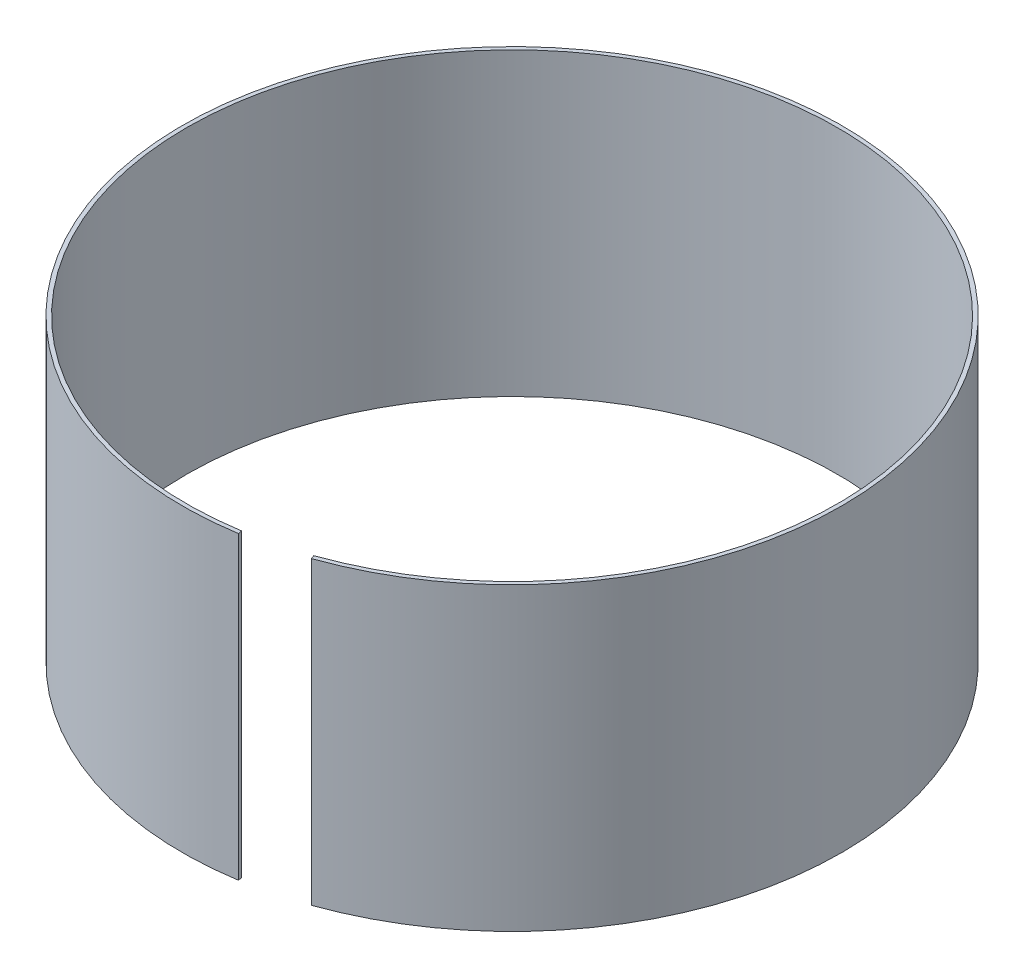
ISO-10303-21;
HEADER;
FILE_DESCRIPTION(('STEP AP214'),'2;1');
FILE_NAME('part.step','',(''),(''),'','','');
FILE_SCHEMA(('AUTOMOTIVE_DESIGN { 1 0 10303 214 1 1 1 1 }'));
ENDSEC;
DATA;
#1=APPLICATION_CONTEXT('core data for automotive mechanical design processes');
#2=APPLICATION_PROTOCOL_DEFINITION('international standard','automotive_design',2000,#1);
#3=PRODUCT_CONTEXT('',#1,'mechanical');
#4=PRODUCT('Part','Part','',(#3));
#5=PRODUCT_RELATED_PRODUCT_CATEGORY('part','',(#4));
#6=PRODUCT_DEFINITION_FORMATION('','',#4);
#7=PRODUCT_DEFINITION_CONTEXT('part definition',#1,'design');
#8=PRODUCT_DEFINITION('design','',#6,#7);
#9=PRODUCT_DEFINITION_SHAPE('','',#8);
#10=(LENGTH_UNIT() NAMED_UNIT(*) SI_UNIT(.MILLI.,.METRE.));
#11=(NAMED_UNIT(*) PLANE_ANGLE_UNIT() SI_UNIT($,.RADIAN.));
#12=(NAMED_UNIT(*) SI_UNIT($,.STERADIAN.) SOLID_ANGLE_UNIT());
#13=UNCERTAINTY_MEASURE_WITH_UNIT(LENGTH_MEASURE(1.E-05),#10,'distance_accuracy_value','');
#14=(GEOMETRIC_REPRESENTATION_CONTEXT(3) GLOBAL_UNCERTAINTY_ASSIGNED_CONTEXT((#13)) GLOBAL_UNIT_ASSIGNED_CONTEXT((#10,
#11,#12)) REPRESENTATION_CONTEXT('',''));
#15=CARTESIAN_POINT('',(0.,0.,0.));
#16=DIRECTION('',(0.,0.,1.));
#17=DIRECTION('',(1.,0.,0.));
#18=AXIS2_PLACEMENT_3D('',#15,#16,#17);
#19=CARTESIAN_POINT('',(0.,96.52,0.));
#20=DIRECTION('',(0.,-1.,0.));
#21=DIRECTION('',(0.,0.,-1.));
#22=AXIS2_PLACEMENT_3D('',#19,#20,#21);
#23=CYLINDRICAL_SURFACE('',#22,104.67922484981);
#24=CARTESIAN_POINT('',(0.,0.,0.));
#25=DIRECTION('',(0.,1.,0.));
#26=DIRECTION('',(1.,0.,0.));
#27=AXIS2_PLACEMENT_3D('',#24,#25,#26);
#28=CIRCLE('',#27,104.67922484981);
#29=CARTESIAN_POINT('',(16.4725699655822,0.,103.375019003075));
#30=VERTEX_POINT('',#29);
#31=CARTESIAN_POINT('',(34.9306081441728,0.,98.6792416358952));
#32=VERTEX_POINT('',#31);
#33=EDGE_CURVE('E79',#30,#32,#28,.F.);
#34=ORIENTED_EDGE('',*,*,#33,.T.);
#35=DIRECTION('',(0.,-1.,0.));
#36=VECTOR('',#35,1.);
#37=CARTESIAN_POINT('',(34.9306081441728,96.52,98.6792416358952));
#38=LINE('',#37,#36);
#39=CARTESIAN_POINT('',(34.9306081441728,96.52,98.6792416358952));
#40=VERTEX_POINT('',#39);
#41=EDGE_CURVE('E11',#40,#32,#38,.T.);
#42=ORIENTED_EDGE('',*,*,#41,.F.);
#43=CARTESIAN_POINT('',(0.,96.52,0.));
#44=DIRECTION('',(0.,1.,0.));
#45=DIRECTION('',(1.,0.,0.));
#46=AXIS2_PLACEMENT_3D('',#43,#44,#45);
#47=CIRCLE('',#46,104.67922484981);
#48=CARTESIAN_POINT('',(16.4725699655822,96.52,103.375019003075));
#49=VERTEX_POINT('',#48);
#50=EDGE_CURVE('E90',#49,#40,#47,.F.);
#51=ORIENTED_EDGE('',*,*,#50,.F.);
#52=DIRECTION('',(0.,-1.,0.));
#53=VECTOR('',#52,1.);
#54=CARTESIAN_POINT('',(16.4725699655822,96.52,103.375019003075));
#55=LINE('',#54,#53);
#56=EDGE_CURVE('E42',#49,#30,#55,.T.);
#57=ORIENTED_EDGE('',*,*,#56,.T.);
#58=EDGE_LOOP('',(#34,#42,#51,#57));
#59=FACE_BOUND('',#58,.T.);
#60=ADVANCED_FACE('F28',(#59),#23,.F.);
#61=CARTESIAN_POINT('',(35.3543968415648,96.52,99.8764480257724));
#62=DIRECTION('',(-0.942682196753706,0.,0.333691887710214));
#63=DIRECTION('',(0.333691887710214,0.,0.942682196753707));
#64=AXIS2_PLACEMENT_3D('',#61,#62,#63);
#65=PLANE('',#64);
#66=DIRECTION('',(-0.333691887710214,0.,-0.942682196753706));
#67=VECTOR('',#66,1.);
#68=CARTESIAN_POINT('',(35.3543968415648,0.,99.8764480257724));
#69=LINE('',#68,#67);
#70=CARTESIAN_POINT('',(35.3543968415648,0.,99.8764480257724));
#71=VERTEX_POINT('',#70);
#72=EDGE_CURVE('E73',#71,#32,#69,.T.);
#73=ORIENTED_EDGE('',*,*,#72,.F.);
#74=DIRECTION('',(0.,-1.,0.));
#75=VECTOR('',#74,1.);
#76=CARTESIAN_POINT('',(35.3543968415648,96.52,99.8764480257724));
#77=LINE('',#76,#75);
#78=CARTESIAN_POINT('',(35.3543968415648,96.52,99.8764480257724));
#79=VERTEX_POINT('',#78);
#80=EDGE_CURVE('E35',#79,#71,#77,.T.);
#81=ORIENTED_EDGE('',*,*,#80,.F.);
#82=DIRECTION('',(-0.333691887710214,0.,-0.942682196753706));
#83=VECTOR('',#82,1.);
#84=CARTESIAN_POINT('',(35.3543968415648,96.52,99.8764480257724));
#85=LINE('',#84,#83);
#86=EDGE_CURVE('E76',#79,#40,#85,.T.);
#87=ORIENTED_EDGE('',*,*,#86,.T.);
#88=ORIENTED_EDGE('',*,*,#41,.T.);
#89=EDGE_LOOP('',(#73,#81,#87,#88));
#90=FACE_BOUND('',#89,.T.);
#91=ADVANCED_FACE('F71',(#90),#65,.T.);
#92=CARTESIAN_POINT('',(0.,96.52,0.));
#93=DIRECTION('',(0.,-1.,0.));
#94=DIRECTION('',(0.,0.,-1.));
#95=AXIS2_PLACEMENT_3D('',#92,#93,#94);
#96=CYLINDRICAL_SURFACE('',#95,105.94922484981);
#97=CARTESIAN_POINT('',(0.,0.,0.));
#98=DIRECTION('',(0.,-1.,0.));
#99=DIRECTION('',(0.,0.,-1.));
#100=AXIS2_PLACEMENT_3D('',#97,#98,#99);
#101=CIRCLE('',#100,105.94922484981);
#102=CARTESIAN_POINT('',(16.6724201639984,0.,104.629195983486));
#103=VERTEX_POINT('',#102);
#104=EDGE_CURVE('E84',#103,#71,#101,.T.);
#105=ORIENTED_EDGE('',*,*,#104,.F.);
#106=DIRECTION('',(0.,-1.,0.));
#107=VECTOR('',#106,1.);
#108=CARTESIAN_POINT('',(16.6724201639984,96.52,104.629195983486));
#109=LINE('',#108,#107);
#110=CARTESIAN_POINT('',(16.6724201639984,96.52,104.629195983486));
#111=VERTEX_POINT('',#110);
#112=EDGE_CURVE('E50',#111,#103,#109,.T.);
#113=ORIENTED_EDGE('',*,*,#112,.F.);
#114=CARTESIAN_POINT('',(0.,96.52,0.));
#115=DIRECTION('',(0.,-1.,0.));
#116=DIRECTION('',(0.,0.,-1.));
#117=AXIS2_PLACEMENT_3D('',#114,#115,#116);
#118=CIRCLE('',#117,105.94922484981);
#119=EDGE_CURVE('E93',#111,#79,#118,.T.);
#120=ORIENTED_EDGE('',*,*,#119,.T.);
#121=ORIENTED_EDGE('',*,*,#80,.T.);
#122=EDGE_LOOP('',(#105,#113,#120,#121));
#123=FACE_BOUND('',#122,.T.);
#124=ADVANCED_FACE('F98',(#123),#96,.T.);
#125=CARTESIAN_POINT('',(16.4725699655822,96.52,103.375019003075));
#126=DIRECTION('',(0.987540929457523,0.,-0.157362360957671));
#127=DIRECTION('',(-0.157362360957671,0.,-0.987540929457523));
#128=AXIS2_PLACEMENT_3D('',#125,#126,#127);
#129=PLANE('',#128);
#130=DIRECTION('',(0.157362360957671,0.,0.987540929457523));
#131=VECTOR('',#130,1.);
#132=CARTESIAN_POINT('',(16.4725699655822,0.,103.375019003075));
#133=LINE('',#132,#131);
#134=EDGE_CURVE('E86',#30,#103,#133,.T.);
#135=ORIENTED_EDGE('',*,*,#134,.F.);
#136=ORIENTED_EDGE('',*,*,#56,.F.);
#137=DIRECTION('',(0.157362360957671,0.,0.987540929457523));
#138=VECTOR('',#137,1.);
#139=CARTESIAN_POINT('',(16.4725699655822,96.52,103.375019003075));
#140=LINE('',#139,#138);
#141=EDGE_CURVE('E95',#49,#111,#140,.T.);
#142=ORIENTED_EDGE('',*,*,#141,.T.);
#143=ORIENTED_EDGE('',*,*,#112,.T.);
#144=EDGE_LOOP('',(#135,#136,#142,#143));
#145=FACE_BOUND('',#144,.T.);
#146=ADVANCED_FACE('F102',(#145),#129,.T.);
#147=CARTESIAN_POINT('',(0.,96.52,0.));
#148=DIRECTION('',(0.,1.,0.));
#149=DIRECTION('',(0.,0.,1.));
#150=AXIS2_PLACEMENT_3D('',#147,#148,#149);
#151=PLANE('',#150);
#152=ORIENTED_EDGE('',*,*,#50,.T.);
#153=ORIENTED_EDGE('',*,*,#86,.F.);
#154=ORIENTED_EDGE('',*,*,#119,.F.);
#155=ORIENTED_EDGE('',*,*,#141,.F.);
#156=EDGE_LOOP('',(#152,#153,#154,#155));
#157=FACE_BOUND('',#156,.T.);
#158=ADVANCED_FACE('F100',(#157),#151,.T.);
#159=CARTESIAN_POINT('',(0.,0.,0.));
#160=DIRECTION('',(0.,1.,0.));
#161=DIRECTION('',(0.,0.,1.));
#162=AXIS2_PLACEMENT_3D('',#159,#160,#161);
#163=PLANE('',#162);
#164=ORIENTED_EDGE('',*,*,#33,.F.);
#165=ORIENTED_EDGE('',*,*,#134,.T.);
#166=ORIENTED_EDGE('',*,*,#104,.T.);
#167=ORIENTED_EDGE('',*,*,#72,.T.);
#168=EDGE_LOOP('',(#164,#165,#166,#167));
#169=FACE_BOUND('',#168,.T.);
#170=ADVANCED_FACE('F83',(#169),#163,.F.);
#171=CLOSED_SHELL('',(#60,#91,#124,#146,#158,#170));
#172=MANIFOLD_SOLID_BREP('B2',#171);
#173=ADVANCED_BREP_SHAPE_REPRESENTATION('',(#18,#172),#14);
#174=SHAPE_DEFINITION_REPRESENTATION(#9,#173);
ENDSEC;
END-ISO-10303-21;
